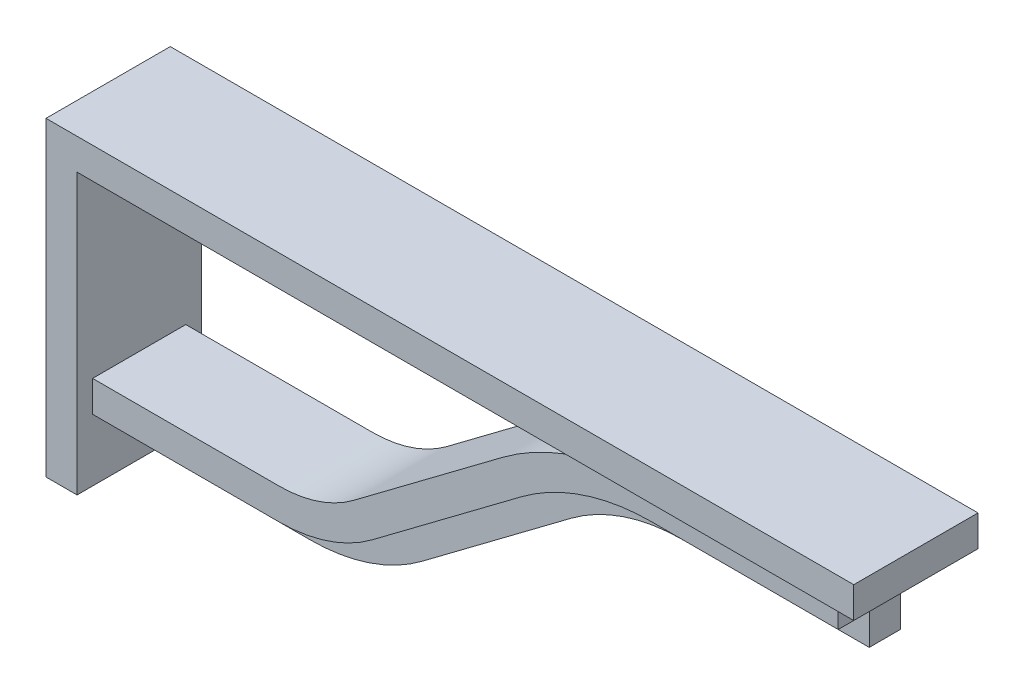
from build123d import *

# Parameters (mm, degrees)
BOSS_EXTRUDE1_DEPTH = 25.4


with BuildPart() as part:
    # Sweep1: sweep along a path in Sketch1
    with BuildLine(Plane.XY) as sweep1_path:
        Line((0, 0), (-76.2, 0))
        ThreePointArc((-76.2, 0), (-100.29655577, -3.910332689), (-121.92, -15.24))
        Line((-121.92, -15.24), (-182.88, -60.96))
        ThreePointArc((-182.88, -60.96), (-204.50344423, -72.289667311), (-228.6, -76.2))
        Line((-228.6, -76.2), (-304.8, -76.2))
    # Sketch2 → Sweep1 (sweep)
    with BuildSketch(Plane(origin=(0, 0, 0), x_dir=(0, 0, -1), z_dir=(1, 0, 0))):
        Polygon((-6.35, 0), (6.35, 0), (6.35, 12.7), (19.05, 12.7), (19.05, 25.4), (-19.05, 25.4), (-19.05, 12.7), (-6.35, 12.7), align=None)
    sweep(path=sweep1_path.line)

    # Sketch3 → Boss-Extrude1 (add, symmetric)
    with BuildSketch(Plane.XY):
        Polygon((12.7, 25.4), (-304.8, 25.4), (-304.8, -88.9), (-317.5, -88.9), (-317.5, 38.1), (12.7, 38.1), align=None)
    extrude(amount=BOSS_EXTRUDE1_DEPTH, both=True)


solid = part.part
